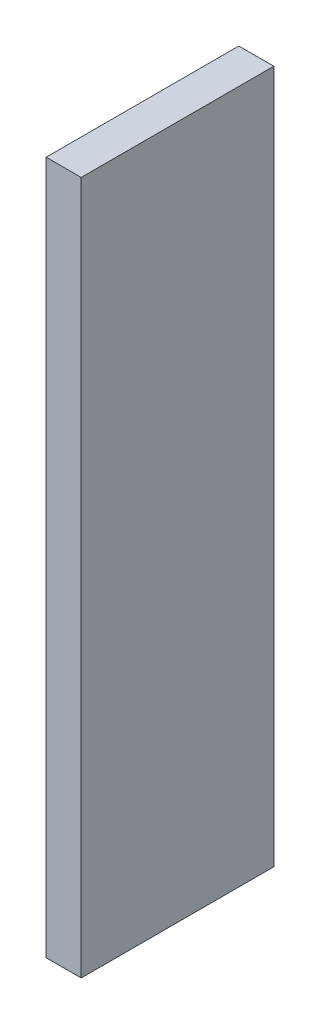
ISO-10303-21;
HEADER;
FILE_DESCRIPTION(('STEP AP214'),'2;1');
FILE_NAME('part.step','',(''),(''),'','','');
FILE_SCHEMA(('AUTOMOTIVE_DESIGN { 1 0 10303 214 1 1 1 1 }'));
ENDSEC;
DATA;
#1=APPLICATION_CONTEXT('core data for automotive mechanical design processes');
#2=APPLICATION_PROTOCOL_DEFINITION('international standard','automotive_design',2000,#1);
#3=PRODUCT_CONTEXT('',#1,'mechanical');
#4=PRODUCT('Part','Part','',(#3));
#5=PRODUCT_RELATED_PRODUCT_CATEGORY('part','',(#4));
#6=PRODUCT_DEFINITION_FORMATION('','',#4);
#7=PRODUCT_DEFINITION_CONTEXT('part definition',#1,'design');
#8=PRODUCT_DEFINITION('design','',#6,#7);
#9=PRODUCT_DEFINITION_SHAPE('','',#8);
#10=(LENGTH_UNIT() NAMED_UNIT(*) SI_UNIT(.MILLI.,.METRE.));
#11=(NAMED_UNIT(*) PLANE_ANGLE_UNIT() SI_UNIT($,.RADIAN.));
#12=(NAMED_UNIT(*) SI_UNIT($,.STERADIAN.) SOLID_ANGLE_UNIT());
#13=UNCERTAINTY_MEASURE_WITH_UNIT(LENGTH_MEASURE(1.E-05),#10,'distance_accuracy_value','');
#14=(GEOMETRIC_REPRESENTATION_CONTEXT(3) GLOBAL_UNCERTAINTY_ASSIGNED_CONTEXT((#13)) GLOBAL_UNIT_ASSIGNED_CONTEXT((#10,
#11,#12)) REPRESENTATION_CONTEXT('',''));
#15=CARTESIAN_POINT('',(0.,0.,0.));
#16=DIRECTION('',(0.,0.,1.));
#17=DIRECTION('',(1.,0.,0.));
#18=AXIS2_PLACEMENT_3D('',#15,#16,#17);
#19=CARTESIAN_POINT('',(-275.141421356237,9.18626735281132E-13,50.));
#20=DIRECTION('',(0.,0.,1.));
#21=DIRECTION('',(0.,-1.,0.));
#22=AXIS2_PLACEMENT_3D('',#19,#20,#21);
#23=PLANE('',#22);
#24=DIRECTION('',(-1.,0.,0.));
#25=VECTOR('',#24,1.);
#26=CARTESIAN_POINT('',(125.,-125.,50.));
#27=LINE('',#26,#25);
#28=CARTESIAN_POINT('',(135.,-125.,50.));
#29=VERTEX_POINT('',#28);
#30=CARTESIAN_POINT('',(125.,-125.,50.));
#31=VERTEX_POINT('',#30);
#32=EDGE_CURVE('E40',#29,#31,#27,.T.);
#33=ORIENTED_EDGE('',*,*,#32,.F.);
#34=DIRECTION('',(0.,-1.,0.));
#35=VECTOR('',#34,1.);
#36=CARTESIAN_POINT('',(135.,-125.,50.));
#37=LINE('',#36,#35);
#38=CARTESIAN_POINT('',(135.,72.9999999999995,50.));
#39=VERTEX_POINT('',#38);
#40=EDGE_CURVE('E63',#39,#29,#37,.T.);
#41=ORIENTED_EDGE('',*,*,#40,.F.);
#42=DIRECTION('',(1.,0.,0.));
#43=VECTOR('',#42,1.);
#44=CARTESIAN_POINT('',(125.,72.9999999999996,50.));
#45=LINE('',#44,#43);
#46=CARTESIAN_POINT('',(125.,72.9999999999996,50.));
#47=VERTEX_POINT('',#46);
#48=EDGE_CURVE('E68',#47,#39,#45,.T.);
#49=ORIENTED_EDGE('',*,*,#48,.F.);
#50=DIRECTION('',(0.,1.,0.));
#51=VECTOR('',#50,1.);
#52=CARTESIAN_POINT('',(125.,-125.,50.));
#53=LINE('',#52,#51);
#54=EDGE_CURVE('E83',#31,#47,#53,.T.);
#55=ORIENTED_EDGE('',*,*,#54,.F.);
#56=EDGE_LOOP('',(#33,#41,#49,#55));
#57=FACE_BOUND('',#56,.T.);
#58=ADVANCED_FACE('F32',(#57),#23,.T.);
#59=CARTESIAN_POINT('',(135.,-125.,-5.));
#60=DIRECTION('',(0.,0.,1.));
#61=DIRECTION('',(0.,-1.,0.));
#62=AXIS2_PLACEMENT_3D('',#59,#60,#61);
#63=PLANE('',#62);
#64=DIRECTION('',(-1.,0.,0.));
#65=VECTOR('',#64,1.);
#66=CARTESIAN_POINT('',(125.,-125.,-5.));
#67=LINE('',#66,#65);
#68=CARTESIAN_POINT('',(135.,-125.,-5.));
#69=VERTEX_POINT('',#68);
#70=CARTESIAN_POINT('',(125.,-125.,-5.));
#71=VERTEX_POINT('',#70);
#72=EDGE_CURVE('E92',#69,#71,#67,.T.);
#73=ORIENTED_EDGE('',*,*,#72,.T.);
#74=DIRECTION('',(0.,1.,0.));
#75=VECTOR('',#74,1.);
#76=CARTESIAN_POINT('',(125.,-125.,-5.));
#77=LINE('',#76,#75);
#78=CARTESIAN_POINT('',(125.,72.9999999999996,-5.));
#79=VERTEX_POINT('',#78);
#80=EDGE_CURVE('E81',#71,#79,#77,.T.);
#81=ORIENTED_EDGE('',*,*,#80,.T.);
#82=DIRECTION('',(1.,0.,0.));
#83=VECTOR('',#82,1.);
#84=CARTESIAN_POINT('',(125.,72.9999999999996,-5.));
#85=LINE('',#84,#83);
#86=CARTESIAN_POINT('',(135.,72.9999999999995,-5.));
#87=VERTEX_POINT('',#86);
#88=EDGE_CURVE('E84',#79,#87,#85,.T.);
#89=ORIENTED_EDGE('',*,*,#88,.T.);
#90=DIRECTION('',(0.,-1.,0.));
#91=VECTOR('',#90,1.);
#92=CARTESIAN_POINT('',(135.,-125.,-5.));
#93=LINE('',#92,#91);
#94=EDGE_CURVE('E89',#87,#69,#93,.T.);
#95=ORIENTED_EDGE('',*,*,#94,.T.);
#96=EDGE_LOOP('',(#73,#81,#89,#95));
#97=FACE_BOUND('',#96,.T.);
#98=ADVANCED_FACE('F91',(#97),#63,.F.);
#99=CARTESIAN_POINT('',(125.,-125.,248.25236442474));
#100=DIRECTION('',(-1.,0.,0.));
#101=DIRECTION('',(0.,0.,-1.));
#102=AXIS2_PLACEMENT_3D('',#99,#100,#101);
#103=PLANE('',#102);
#104=DIRECTION('',(0.,0.,-1.));
#105=VECTOR('',#104,1.);
#106=CARTESIAN_POINT('',(125.,-125.,248.25236442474));
#107=LINE('',#106,#105);
#108=EDGE_CURVE('E11',#31,#71,#107,.T.);
#109=ORIENTED_EDGE('',*,*,#108,.F.);
#110=ORIENTED_EDGE('',*,*,#54,.T.);
#111=DIRECTION('',(0.,0.,-1.));
#112=VECTOR('',#111,1.);
#113=CARTESIAN_POINT('',(125.,72.9999999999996,248.25236442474));
#114=LINE('',#113,#112);
#115=EDGE_CURVE('E78',#47,#79,#114,.T.);
#116=ORIENTED_EDGE('',*,*,#115,.T.);
#117=ORIENTED_EDGE('',*,*,#80,.F.);
#118=EDGE_LOOP('',(#109,#110,#116,#117));
#119=FACE_BOUND('',#118,.T.);
#120=ADVANCED_FACE('F79',(#119),#103,.T.);
#121=CARTESIAN_POINT('',(125.,72.9999999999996,248.25236442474));
#122=DIRECTION('',(0.,1.,0.));
#123=DIRECTION('',(0.,0.,1.));
#124=AXIS2_PLACEMENT_3D('',#121,#122,#123);
#125=PLANE('',#124);
#126=ORIENTED_EDGE('',*,*,#115,.F.);
#127=ORIENTED_EDGE('',*,*,#48,.T.);
#128=DIRECTION('',(0.,0.,-1.));
#129=VECTOR('',#128,1.);
#130=CARTESIAN_POINT('',(135.,72.9999999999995,248.25236442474));
#131=LINE('',#130,#129);
#132=EDGE_CURVE('E73',#39,#87,#131,.T.);
#133=ORIENTED_EDGE('',*,*,#132,.T.);
#134=ORIENTED_EDGE('',*,*,#88,.F.);
#135=EDGE_LOOP('',(#126,#127,#133,#134));
#136=FACE_BOUND('',#135,.T.);
#137=ADVANCED_FACE('F85',(#136),#125,.T.);
#138=CARTESIAN_POINT('',(135.,-125.,248.25236442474));
#139=DIRECTION('',(1.,0.,0.));
#140=DIRECTION('',(0.,0.,1.));
#141=AXIS2_PLACEMENT_3D('',#138,#139,#140);
#142=PLANE('',#141);
#143=ORIENTED_EDGE('',*,*,#132,.F.);
#144=ORIENTED_EDGE('',*,*,#40,.T.);
#145=DIRECTION('',(0.,0.,-1.));
#146=VECTOR('',#145,1.);
#147=CARTESIAN_POINT('',(135.,-125.,248.25236442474));
#148=LINE('',#147,#146);
#149=EDGE_CURVE('E99',#29,#69,#148,.T.);
#150=ORIENTED_EDGE('',*,*,#149,.T.);
#151=ORIENTED_EDGE('',*,*,#94,.F.);
#152=EDGE_LOOP('',(#143,#144,#150,#151));
#153=FACE_BOUND('',#152,.T.);
#154=ADVANCED_FACE('F105',(#153),#142,.T.);
#155=CARTESIAN_POINT('',(125.,-125.,248.25236442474));
#156=DIRECTION('',(0.,-1.,0.));
#157=DIRECTION('',(0.,0.,-1.));
#158=AXIS2_PLACEMENT_3D('',#155,#156,#157);
#159=PLANE('',#158);
#160=ORIENTED_EDGE('',*,*,#149,.F.);
#161=ORIENTED_EDGE('',*,*,#32,.T.);
#162=ORIENTED_EDGE('',*,*,#108,.T.);
#163=ORIENTED_EDGE('',*,*,#72,.F.);
#164=EDGE_LOOP('',(#160,#161,#162,#163));
#165=FACE_BOUND('',#164,.T.);
#166=ADVANCED_FACE('F106',(#165),#159,.T.);
#167=CLOSED_SHELL('',(#58,#98,#120,#137,#154,#166));
#168=MANIFOLD_SOLID_BREP('B2',#167);
#169=ADVANCED_BREP_SHAPE_REPRESENTATION('',(#18,#168),#14);
#170=SHAPE_DEFINITION_REPRESENTATION(#9,#169);
ENDSEC;
END-ISO-10303-21;
